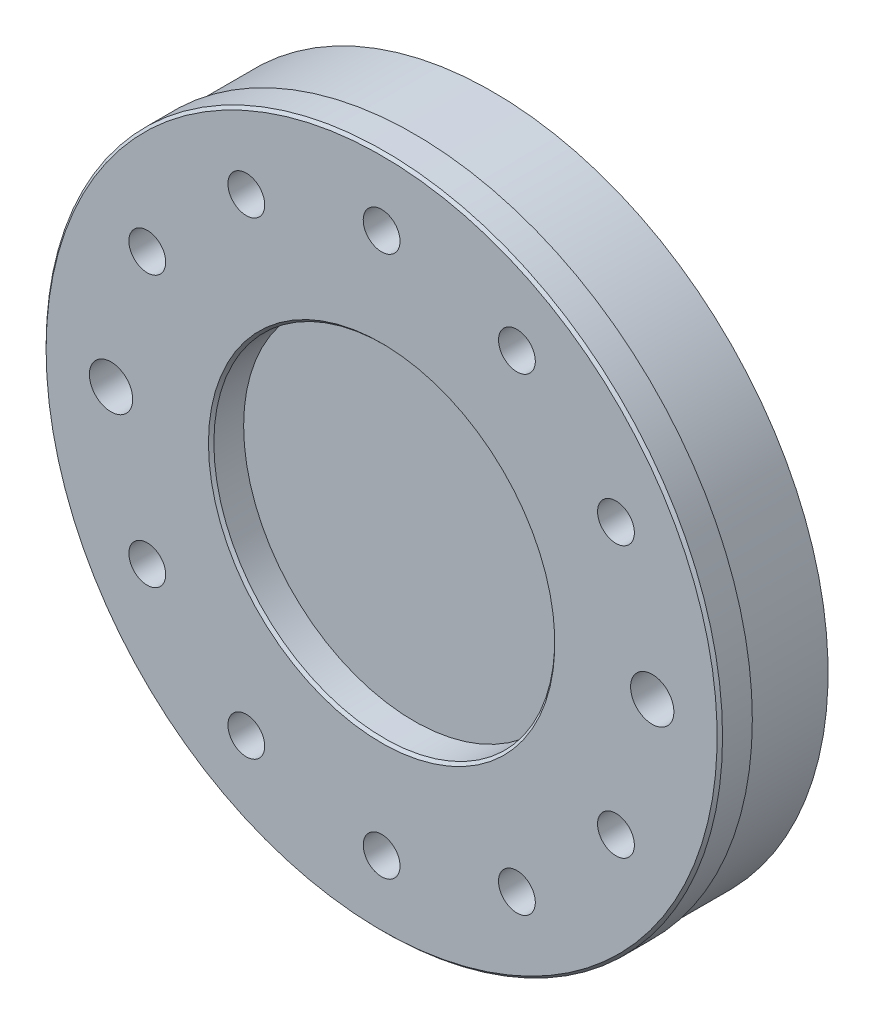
ISO-10303-21;
HEADER;
FILE_DESCRIPTION(('STEP AP214'),'2;1');
FILE_NAME('part.step','',(''),(''),'','','');
FILE_SCHEMA(('AUTOMOTIVE_DESIGN { 1 0 10303 214 1 1 1 1 }'));
ENDSEC;
DATA;
#1=APPLICATION_CONTEXT('core data for automotive mechanical design processes');
#2=APPLICATION_PROTOCOL_DEFINITION('international standard','automotive_design',2000,#1);
#3=PRODUCT_CONTEXT('',#1,'mechanical');
#4=PRODUCT('Part','Part','',(#3));
#5=PRODUCT_RELATED_PRODUCT_CATEGORY('part','',(#4));
#6=PRODUCT_DEFINITION_FORMATION('','',#4);
#7=PRODUCT_DEFINITION_CONTEXT('part definition',#1,'design');
#8=PRODUCT_DEFINITION('design','',#6,#7);
#9=PRODUCT_DEFINITION_SHAPE('','',#8);
#10=(LENGTH_UNIT() NAMED_UNIT(*) SI_UNIT(.MILLI.,.METRE.));
#11=(NAMED_UNIT(*) PLANE_ANGLE_UNIT() SI_UNIT($,.RADIAN.));
#12=(NAMED_UNIT(*) SI_UNIT($,.STERADIAN.) SOLID_ANGLE_UNIT());
#13=UNCERTAINTY_MEASURE_WITH_UNIT(LENGTH_MEASURE(1.E-05),#10,'distance_accuracy_value','');
#14=(GEOMETRIC_REPRESENTATION_CONTEXT(3) GLOBAL_UNCERTAINTY_ASSIGNED_CONTEXT((#13)) GLOBAL_UNIT_ASSIGNED_CONTEXT((#10,
#11,#12)) REPRESENTATION_CONTEXT('',''));
#15=CARTESIAN_POINT('',(0.,0.,0.));
#16=DIRECTION('',(0.,0.,1.));
#17=DIRECTION('',(1.,0.,0.));
#18=AXIS2_PLACEMENT_3D('',#15,#16,#17);
#19=CARTESIAN_POINT('',(0.,0.,0.));
#20=DIRECTION('',(0.,0.,-1.));
#21=DIRECTION('',(-1.,0.,0.));
#22=AXIS2_PLACEMENT_3D('',#19,#20,#21);
#23=PLANE('',#22);
#24=CARTESIAN_POINT('',(-24.9999999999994,-43.3012701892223,0.));
#25=DIRECTION('',(0.,0.,1.));
#26=DIRECTION('',(0.,-1.,0.));
#27=AXIS2_PLACEMENT_3D('',#24,#25,#26);
#28=CIRCLE('',#27,3.4);
#29=CARTESIAN_POINT('',(-24.9999999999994,-46.7012701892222,0.));
#30=VERTEX_POINT('',#29);
#31=EDGE_CURVE('E92',#30,#30,#28,.T.);
#32=ORIENTED_EDGE('',*,*,#31,.F.);
#33=EDGE_LOOP('',(#32));
#34=FACE_BOUND('',#33,.T.);
#35=CARTESIAN_POINT('',(-43.3012701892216,-25.0000000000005,0.));
#36=DIRECTION('',(0.,0.,1.));
#37=DIRECTION('',(0.,-1.,0.));
#38=AXIS2_PLACEMENT_3D('',#35,#36,#37);
#39=CIRCLE('',#38,3.4);
#40=CARTESIAN_POINT('',(-43.3012701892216,-28.4000000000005,0.));
#41=VERTEX_POINT('',#40);
#42=EDGE_CURVE('E100',#41,#41,#39,.T.);
#43=ORIENTED_EDGE('',*,*,#42,.F.);
#44=EDGE_LOOP('',(#43));
#45=FACE_BOUND('',#44,.T.);
#46=CARTESIAN_POINT('',(-43.3012701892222,24.9999999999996,0.));
#47=DIRECTION('',(0.,0.,1.));
#48=DIRECTION('',(0.,-1.,0.));
#49=AXIS2_PLACEMENT_3D('',#46,#47,#48);
#50=CIRCLE('',#49,3.4);
#51=CARTESIAN_POINT('',(-43.3012701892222,21.5999999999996,0.));
#52=VERTEX_POINT('',#51);
#53=EDGE_CURVE('E106',#52,#52,#50,.T.);
#54=ORIENTED_EDGE('',*,*,#53,.F.);
#55=EDGE_LOOP('',(#54));
#56=FACE_BOUND('',#55,.T.);
#57=CARTESIAN_POINT('',(-25.0000000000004,43.3012701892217,0.));
#58=DIRECTION('',(0.,0.,1.));
#59=DIRECTION('',(0.,-1.,0.));
#60=AXIS2_PLACEMENT_3D('',#57,#58,#59);
#61=CIRCLE('',#60,3.4);
#62=CARTESIAN_POINT('',(-25.0000000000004,39.9012701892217,0.));
#63=VERTEX_POINT('',#62);
#64=EDGE_CURVE('E112',#63,#63,#61,.T.);
#65=ORIENTED_EDGE('',*,*,#64,.F.);
#66=EDGE_LOOP('',(#65));
#67=FACE_BOUND('',#66,.T.);
#68=CARTESIAN_POINT('',(-3.49148336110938E-13,50.,0.));
#69=DIRECTION('',(0.,0.,1.));
#70=DIRECTION('',(0.,-1.,0.));
#71=AXIS2_PLACEMENT_3D('',#68,#69,#70);
#72=CIRCLE('',#71,3.4);
#73=CARTESIAN_POINT('',(-3.49148336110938E-13,46.6,0.));
#74=VERTEX_POINT('',#73);
#75=EDGE_CURVE('E118',#74,#74,#72,.T.);
#76=ORIENTED_EDGE('',*,*,#75,.F.);
#77=EDGE_LOOP('',(#76));
#78=FACE_BOUND('',#77,.T.);
#79=CARTESIAN_POINT('',(24.9999999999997,43.3012701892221,0.));
#80=DIRECTION('',(0.,0.,1.));
#81=DIRECTION('',(0.,-1.,0.));
#82=AXIS2_PLACEMENT_3D('',#79,#80,#81);
#83=CIRCLE('',#82,3.4);
#84=CARTESIAN_POINT('',(24.9999999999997,39.9012701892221,0.));
#85=VERTEX_POINT('',#84);
#86=EDGE_CURVE('E124',#85,#85,#83,.T.);
#87=ORIENTED_EDGE('',*,*,#86,.F.);
#88=EDGE_LOOP('',(#87));
#89=FACE_BOUND('',#88,.T.);
#90=CARTESIAN_POINT('',(43.3012701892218,25.0000000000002,0.));
#91=DIRECTION('',(0.,0.,1.));
#92=DIRECTION('',(0.,-1.,0.));
#93=AXIS2_PLACEMENT_3D('',#90,#91,#92);
#94=CIRCLE('',#93,3.39999999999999);
#95=CARTESIAN_POINT('',(43.3012701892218,21.6000000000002,0.));
#96=VERTEX_POINT('',#95);
#97=EDGE_CURVE('E130',#96,#96,#94,.T.);
#98=ORIENTED_EDGE('',*,*,#97,.F.);
#99=EDGE_LOOP('',(#98));
#100=FACE_BOUND('',#99,.T.);
#101=CARTESIAN_POINT('',(43.301270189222,-24.9999999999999,0.));
#102=DIRECTION('',(0.,0.,1.));
#103=DIRECTION('',(0.,-1.,0.));
#104=AXIS2_PLACEMENT_3D('',#101,#102,#103);
#105=CIRCLE('',#104,3.39999999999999);
#106=CARTESIAN_POINT('',(43.301270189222,-28.3999999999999,0.));
#107=VERTEX_POINT('',#106);
#108=EDGE_CURVE('E136',#107,#107,#105,.T.);
#109=ORIENTED_EDGE('',*,*,#108,.F.);
#110=EDGE_LOOP('',(#109));
#111=FACE_BOUND('',#110,.T.);
#112=CARTESIAN_POINT('',(25.,-43.3012701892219,0.));
#113=DIRECTION('',(0.,0.,1.));
#114=DIRECTION('',(0.,-1.,0.));
#115=AXIS2_PLACEMENT_3D('',#112,#113,#114);
#116=CIRCLE('',#115,3.4);
#117=CARTESIAN_POINT('',(25.,-46.7012701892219,0.));
#118=VERTEX_POINT('',#117);
#119=EDGE_CURVE('E142',#118,#118,#116,.T.);
#120=ORIENTED_EDGE('',*,*,#119,.F.);
#121=EDGE_LOOP('',(#120));
#122=FACE_BOUND('',#121,.T.);
#123=CARTESIAN_POINT('',(0.,-50.,0.));
#124=DIRECTION('',(0.,0.,1.));
#125=DIRECTION('',(1.,0.,0.));
#126=AXIS2_PLACEMENT_3D('',#123,#124,#125);
#127=CIRCLE('',#126,3.4);
#128=CARTESIAN_POINT('',(3.4,-50.,0.));
#129=VERTEX_POINT('',#128);
#130=EDGE_CURVE('E148',#129,#129,#127,.T.);
#131=ORIENTED_EDGE('',*,*,#130,.F.);
#132=EDGE_LOOP('',(#131));
#133=FACE_BOUND('',#132,.T.);
#134=CARTESIAN_POINT('',(50.,0.,0.));
#135=DIRECTION('',(0.,0.,1.));
#136=DIRECTION('',(1.,0.,0.));
#137=AXIS2_PLACEMENT_3D('',#134,#135,#136);
#138=CIRCLE('',#137,4.);
#139=CARTESIAN_POINT('',(54.,0.,0.));
#140=VERTEX_POINT('',#139);
#141=EDGE_CURVE('E154',#140,#140,#138,.T.);
#142=ORIENTED_EDGE('',*,*,#141,.F.);
#143=EDGE_LOOP('',(#142));
#144=FACE_BOUND('',#143,.T.);
#145=CARTESIAN_POINT('',(-50.,0.,0.));
#146=DIRECTION('',(0.,0.,1.));
#147=DIRECTION('',(1.,0.,0.));
#148=AXIS2_PLACEMENT_3D('',#145,#146,#147);
#149=CIRCLE('',#148,4.);
#150=CARTESIAN_POINT('',(-46.,0.,0.));
#151=VERTEX_POINT('',#150);
#152=EDGE_CURVE('E160',#151,#151,#149,.T.);
#153=ORIENTED_EDGE('',*,*,#152,.F.);
#154=EDGE_LOOP('',(#153));
#155=FACE_BOUND('',#154,.T.);
#156=CARTESIAN_POINT('',(0.,0.,0.));
#157=DIRECTION('',(0.,0.,-1.));
#158=DIRECTION('',(-1.,0.,0.));
#159=AXIS2_PLACEMENT_3D('',#156,#157,#158);
#160=CIRCLE('',#159,62.);
#161=CARTESIAN_POINT('',(-62.,0.,0.));
#162=VERTEX_POINT('',#161);
#163=EDGE_CURVE('E46',#162,#162,#160,.F.);
#164=ORIENTED_EDGE('',*,*,#163,.T.);
#165=EDGE_LOOP('',(#164));
#166=FACE_BOUND('',#165,.T.);
#167=CARTESIAN_POINT('',(0.,0.,0.));
#168=DIRECTION('',(0.,0.,-1.));
#169=DIRECTION('',(-1.,0.,0.));
#170=AXIS2_PLACEMENT_3D('',#167,#168,#169);
#171=CIRCLE('',#170,32.);
#172=CARTESIAN_POINT('',(-32.,0.,0.));
#173=VERTEX_POINT('',#172);
#174=EDGE_CURVE('E178',#173,#173,#171,.T.);
#175=ORIENTED_EDGE('',*,*,#174,.T.);
#176=EDGE_LOOP('',(#175));
#177=FACE_BOUND('',#176,.T.);
#178=ADVANCED_FACE('F38',(#34,#45,#56,#67,#78,#89,#100,#111,#122,#133,#144,#155,#166,#177),#23,.F.);
#179=CARTESIAN_POINT('',(0.,0.,-20.5));
#180=DIRECTION('',(0.,0.,1.));
#181=DIRECTION('',(1.,0.,0.));
#182=AXIS2_PLACEMENT_3D('',#179,#180,#181);
#183=PLANE('',#182);
#184=CARTESIAN_POINT('',(0.,0.,-20.5));
#185=DIRECTION('',(0.,0.,-1.));
#186=DIRECTION('',(-1.,0.,0.));
#187=AXIS2_PLACEMENT_3D('',#184,#185,#186);
#188=CIRCLE('',#187,62.);
#189=CARTESIAN_POINT('',(-62.,0.,-20.5));
#190=VERTEX_POINT('',#189);
#191=EDGE_CURVE('E172',#190,#190,#188,.T.);
#192=ORIENTED_EDGE('',*,*,#191,.T.);
#193=EDGE_LOOP('',(#192));
#194=FACE_BOUND('',#193,.T.);
#195=ADVANCED_FACE('F40',(#194),#183,.F.);
#196=CARTESIAN_POINT('',(0.,0.,-20.5));
#197=DIRECTION('',(0.,0.,-1.));
#198=DIRECTION('',(-1.,0.,0.));
#199=AXIS2_PLACEMENT_3D('',#196,#197,#198);
#200=CYLINDRICAL_SURFACE('',#199,62.);
#201=ORIENTED_EDGE('',*,*,#191,.F.);
#202=EDGE_LOOP('',(#201));
#203=FACE_BOUND('',#202,.T.);
#204=CARTESIAN_POINT('',(0.,0.,-6.));
#205=DIRECTION('',(0.,0.,-1.));
#206=DIRECTION('',(-1.,0.,0.));
#207=AXIS2_PLACEMENT_3D('',#204,#205,#206);
#208=CIRCLE('',#207,62.);
#209=CARTESIAN_POINT('',(-62.,0.,-6.));
#210=VERTEX_POINT('',#209);
#211=EDGE_CURVE('E169',#210,#210,#208,.T.);
#212=ORIENTED_EDGE('',*,*,#211,.T.);
#213=EDGE_LOOP('',(#212));
#214=FACE_BOUND('',#213,.T.);
#215=ADVANCED_FACE('F202',(#203,#214),#200,.T.);
#216=CARTESIAN_POINT('',(62.,0.,-6.));
#217=DIRECTION('',(0.,0.,1.));
#218=DIRECTION('',(1.,0.,0.));
#219=AXIS2_PLACEMENT_3D('',#216,#217,#218);
#220=PLANE('',#219);
#221=ORIENTED_EDGE('',*,*,#211,.F.);
#222=EDGE_LOOP('',(#221));
#223=FACE_BOUND('',#222,.T.);
#224=CARTESIAN_POINT('',(0.,0.,-6.));
#225=DIRECTION('',(0.,0.,-1.));
#226=DIRECTION('',(-1.,0.,0.));
#227=AXIS2_PLACEMENT_3D('',#224,#225,#226);
#228=CIRCLE('',#227,62.5);
#229=CARTESIAN_POINT('',(-62.5,0.,-6.));
#230=VERTEX_POINT('',#229);
#231=EDGE_CURVE('E166',#230,#230,#228,.T.);
#232=ORIENTED_EDGE('',*,*,#231,.T.);
#233=EDGE_LOOP('',(#232));
#234=FACE_BOUND('',#233,.T.);
#235=ADVANCED_FACE('F197',(#223,#234),#220,.F.);
#236=CARTESIAN_POINT('',(0.,0.,-20.5));
#237=DIRECTION('',(0.,0.,-1.));
#238=DIRECTION('',(-1.,0.,0.));
#239=AXIS2_PLACEMENT_3D('',#236,#237,#238);
#240=CYLINDRICAL_SURFACE('',#239,62.5);
#241=CARTESIAN_POINT('',(0.,0.,-0.499999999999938));
#242=DIRECTION('',(0.,0.,-1.));
#243=DIRECTION('',(-1.,0.,0.));
#244=AXIS2_PLACEMENT_3D('',#241,#242,#243);
#245=CIRCLE('',#244,62.5);
#246=CARTESIAN_POINT('',(-62.5,0.,-0.499999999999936));
#247=VERTEX_POINT('',#246);
#248=EDGE_CURVE('E175',#247,#247,#245,.T.);
#249=ORIENTED_EDGE('',*,*,#248,.T.);
#250=EDGE_LOOP('',(#249));
#251=FACE_BOUND('',#250,.T.);
#252=ORIENTED_EDGE('',*,*,#231,.F.);
#253=EDGE_LOOP('',(#252));
#254=FACE_BOUND('',#253,.T.);
#255=ADVANCED_FACE('F193',(#251,#254),#240,.T.);
#256=CARTESIAN_POINT('',(0.,0.,-6.));
#257=DIRECTION('',(0.,0.,1.));
#258=DIRECTION('',(1.,0.,0.));
#259=AXIS2_PLACEMENT_3D('',#256,#257,#258);
#260=CYLINDRICAL_SURFACE('',#259,31.5);
#261=CARTESIAN_POINT('',(0.,0.,-0.499999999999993));
#262=DIRECTION('',(0.,0.,-1.));
#263=DIRECTION('',(-1.,0.,0.));
#264=AXIS2_PLACEMENT_3D('',#261,#262,#263);
#265=CIRCLE('',#264,31.5);
#266=CARTESIAN_POINT('',(-31.5,0.,-0.499999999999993));
#267=VERTEX_POINT('',#266);
#268=EDGE_CURVE('E11',#267,#267,#265,.F.);
#269=ORIENTED_EDGE('',*,*,#268,.T.);
#270=EDGE_LOOP('',(#269));
#271=FACE_BOUND('',#270,.T.);
#272=CARTESIAN_POINT('',(0.,0.,-6.));
#273=DIRECTION('',(0.,0.,-1.));
#274=DIRECTION('',(-1.,0.,0.));
#275=AXIS2_PLACEMENT_3D('',#272,#273,#274);
#276=CIRCLE('',#275,31.5);
#277=CARTESIAN_POINT('',(-31.5,0.,-6.));
#278=VERTEX_POINT('',#277);
#279=EDGE_CURVE('E163',#278,#278,#276,.T.);
#280=ORIENTED_EDGE('',*,*,#279,.T.);
#281=EDGE_LOOP('',(#280));
#282=FACE_BOUND('',#281,.T.);
#283=ADVANCED_FACE('F196',(#271,#282),#260,.F.);
#284=CARTESIAN_POINT('',(0.,0.,-6.));
#285=DIRECTION('',(0.,0.,-1.));
#286=DIRECTION('',(-1.,0.,0.));
#287=AXIS2_PLACEMENT_3D('',#284,#285,#286);
#288=PLANE('',#287);
#289=ORIENTED_EDGE('',*,*,#279,.F.);
#290=EDGE_LOOP('',(#289));
#291=FACE_BOUND('',#290,.T.);
#292=ADVANCED_FACE('F189',(#291),#288,.F.);
#293=CARTESIAN_POINT('',(0.,0.,-0.499999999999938));
#294=DIRECTION('',(0.,0.,-1.));
#295=DIRECTION('',(-1.,0.,0.));
#296=AXIS2_PLACEMENT_3D('',#293,#294,#295);
#297=CONICAL_SURFACE('',#296,62.5,0.785398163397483);
#298=ORIENTED_EDGE('',*,*,#163,.F.);
#299=EDGE_LOOP('',(#298));
#300=FACE_BOUND('',#299,.T.);
#301=ORIENTED_EDGE('',*,*,#248,.F.);
#302=EDGE_LOOP('',(#301));
#303=FACE_BOUND('',#302,.T.);
#304=ADVANCED_FACE('F185',(#300,#303),#297,.T.);
#305=CARTESIAN_POINT('',(0.,0.,0.));
#306=DIRECTION('',(0.,0.,1.));
#307=DIRECTION('',(1.,0.,0.));
#308=AXIS2_PLACEMENT_3D('',#305,#306,#307);
#309=CONICAL_SURFACE('',#308,32.,0.785398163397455);
#310=ORIENTED_EDGE('',*,*,#268,.F.);
#311=EDGE_LOOP('',(#310));
#312=FACE_BOUND('',#311,.T.);
#313=ORIENTED_EDGE('',*,*,#174,.F.);
#314=EDGE_LOOP('',(#313));
#315=FACE_BOUND('',#314,.T.);
#316=ADVANCED_FACE('F188',(#312,#315),#309,.F.);
#317=CARTESIAN_POINT('',(-50.,0.,0.));
#318=DIRECTION('',(0.,0.,1.));
#319=DIRECTION('',(1.,0.,0.));
#320=AXIS2_PLACEMENT_3D('',#317,#318,#319);
#321=CYLINDRICAL_SURFACE('',#320,4.);
#322=CARTESIAN_POINT('',(-50.,0.,-15.));
#323=DIRECTION('',(0.,0.,1.));
#324=DIRECTION('',(1.,0.,0.));
#325=AXIS2_PLACEMENT_3D('',#322,#323,#324);
#326=CIRCLE('',#325,4.);
#327=CARTESIAN_POINT('',(-46.,0.,-15.));
#328=VERTEX_POINT('',#327);
#329=EDGE_CURVE('E157',#328,#328,#326,.T.);
#330=ORIENTED_EDGE('',*,*,#329,.F.);
#331=EDGE_LOOP('',(#330));
#332=FACE_BOUND('',#331,.T.);
#333=ORIENTED_EDGE('',*,*,#152,.T.);
#334=EDGE_LOOP('',(#333));
#335=FACE_BOUND('',#334,.T.);
#336=ADVANCED_FACE('F228',(#332,#335),#321,.F.);
#337=CARTESIAN_POINT('',(-50.,0.,-15.));
#338=DIRECTION('',(0.,0.,1.));
#339=DIRECTION('',(1.,0.,0.));
#340=AXIS2_PLACEMENT_3D('',#337,#338,#339);
#341=CONICAL_SURFACE('',#340,4.,1.02974425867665);
#342=CARTESIAN_POINT('',(-50.,0.,-17.4034424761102));
#343=VERTEX_POINT('',#342);
#344=VERTEX_LOOP('',#343);
#345=FACE_BOUND('',#344,.T.);
#346=ORIENTED_EDGE('',*,*,#329,.T.);
#347=EDGE_LOOP('',(#346));
#348=FACE_BOUND('',#347,.T.);
#349=ADVANCED_FACE('F232',(#345,#348),#341,.F.);
#350=CARTESIAN_POINT('',(50.,0.,0.));
#351=DIRECTION('',(0.,0.,1.));
#352=DIRECTION('',(1.,0.,0.));
#353=AXIS2_PLACEMENT_3D('',#350,#351,#352);
#354=CYLINDRICAL_SURFACE('',#353,4.);
#355=CARTESIAN_POINT('',(50.,0.,-15.));
#356=DIRECTION('',(0.,0.,1.));
#357=DIRECTION('',(1.,0.,0.));
#358=AXIS2_PLACEMENT_3D('',#355,#356,#357);
#359=CIRCLE('',#358,4.);
#360=CARTESIAN_POINT('',(54.,0.,-15.));
#361=VERTEX_POINT('',#360);
#362=EDGE_CURVE('E151',#361,#361,#359,.T.);
#363=ORIENTED_EDGE('',*,*,#362,.F.);
#364=EDGE_LOOP('',(#363));
#365=FACE_BOUND('',#364,.T.);
#366=ORIENTED_EDGE('',*,*,#141,.T.);
#367=EDGE_LOOP('',(#366));
#368=FACE_BOUND('',#367,.T.);
#369=ADVANCED_FACE('F236',(#365,#368),#354,.F.);
#370=CARTESIAN_POINT('',(50.,0.,-15.));
#371=DIRECTION('',(0.,0.,1.));
#372=DIRECTION('',(1.,0.,0.));
#373=AXIS2_PLACEMENT_3D('',#370,#371,#372);
#374=CONICAL_SURFACE('',#373,4.,1.02974425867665);
#375=CARTESIAN_POINT('',(50.,0.,-17.4034424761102));
#376=VERTEX_POINT('',#375);
#377=VERTEX_LOOP('',#376);
#378=FACE_BOUND('',#377,.T.);
#379=ORIENTED_EDGE('',*,*,#362,.T.);
#380=EDGE_LOOP('',(#379));
#381=FACE_BOUND('',#380,.T.);
#382=ADVANCED_FACE('F239',(#378,#381),#374,.F.);
#383=CARTESIAN_POINT('',(0.,-50.,0.));
#384=DIRECTION('',(0.,0.,1.));
#385=DIRECTION('',(1.,0.,0.));
#386=AXIS2_PLACEMENT_3D('',#383,#384,#385);
#387=CYLINDRICAL_SURFACE('',#386,3.4);
#388=CARTESIAN_POINT('',(0.,-50.,-18.));
#389=DIRECTION('',(0.,0.,1.));
#390=DIRECTION('',(1.,0.,0.));
#391=AXIS2_PLACEMENT_3D('',#388,#389,#390);
#392=CIRCLE('',#391,3.4);
#393=CARTESIAN_POINT('',(3.4,-50.,-18.));
#394=VERTEX_POINT('',#393);
#395=EDGE_CURVE('E145',#394,#394,#392,.T.);
#396=ORIENTED_EDGE('',*,*,#395,.F.);
#397=EDGE_LOOP('',(#396));
#398=FACE_BOUND('',#397,.T.);
#399=ORIENTED_EDGE('',*,*,#130,.T.);
#400=EDGE_LOOP('',(#399));
#401=FACE_BOUND('',#400,.T.);
#402=ADVANCED_FACE('F243',(#398,#401),#387,.F.);
#403=CARTESIAN_POINT('',(0.,-50.,-18.));
#404=DIRECTION('',(0.,0.,1.));
#405=DIRECTION('',(1.,0.,0.));
#406=AXIS2_PLACEMENT_3D('',#403,#404,#405);
#407=CONICAL_SURFACE('',#406,3.4,1.02974425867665);
#408=CARTESIAN_POINT('',(0.,-50.,-20.0429261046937));
#409=VERTEX_POINT('',#408);
#410=VERTEX_LOOP('',#409);
#411=FACE_BOUND('',#410,.T.);
#412=ORIENTED_EDGE('',*,*,#395,.T.);
#413=EDGE_LOOP('',(#412));
#414=FACE_BOUND('',#413,.T.);
#415=ADVANCED_FACE('F246',(#411,#414),#407,.F.);
#416=CARTESIAN_POINT('',(25.,-43.3012701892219,0.));
#417=DIRECTION('',(0.,0.,1.));
#418=DIRECTION('',(0.,-1.,0.));
#419=AXIS2_PLACEMENT_3D('',#416,#417,#418);
#420=CYLINDRICAL_SURFACE('',#419,3.4);
#421=CARTESIAN_POINT('',(25.,-43.3012701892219,-18.));
#422=DIRECTION('',(0.,0.,1.));
#423=DIRECTION('',(0.,-1.,0.));
#424=AXIS2_PLACEMENT_3D('',#421,#422,#423);
#425=CIRCLE('',#424,3.39999999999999);
#426=CARTESIAN_POINT('',(25.,-46.7012701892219,-18.));
#427=VERTEX_POINT('',#426);
#428=EDGE_CURVE('E139',#427,#427,#425,.T.);
#429=ORIENTED_EDGE('',*,*,#428,.F.);
#430=EDGE_LOOP('',(#429));
#431=FACE_BOUND('',#430,.T.);
#432=ORIENTED_EDGE('',*,*,#119,.T.);
#433=EDGE_LOOP('',(#432));
#434=FACE_BOUND('',#433,.T.);
#435=ADVANCED_FACE('F250',(#431,#434),#420,.F.);
#436=CARTESIAN_POINT('',(25.,-43.3012701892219,-18.));
#437=DIRECTION('',(0.,0.,1.));
#438=DIRECTION('',(0.,-1.,0.));
#439=AXIS2_PLACEMENT_3D('',#436,#437,#438);
#440=CONICAL_SURFACE('',#439,3.39999999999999,1.02974425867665);
#441=CARTESIAN_POINT('',(25.,-43.3012701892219,-20.0429261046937));
#442=VERTEX_POINT('',#441);
#443=VERTEX_LOOP('',#442);
#444=FACE_BOUND('',#443,.T.);
#445=ORIENTED_EDGE('',*,*,#428,.T.);
#446=EDGE_LOOP('',(#445));
#447=FACE_BOUND('',#446,.T.);
#448=ADVANCED_FACE('F254',(#444,#447),#440,.F.);
#449=CARTESIAN_POINT('',(43.301270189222,-24.9999999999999,0.));
#450=DIRECTION('',(0.,0.,1.));
#451=DIRECTION('',(0.,-1.,0.));
#452=AXIS2_PLACEMENT_3D('',#449,#450,#451);
#453=CYLINDRICAL_SURFACE('',#452,3.39999999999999);
#454=CARTESIAN_POINT('',(43.301270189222,-24.9999999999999,-18.));
#455=DIRECTION('',(0.,0.,1.));
#456=DIRECTION('',(0.,-1.,0.));
#457=AXIS2_PLACEMENT_3D('',#454,#455,#456);
#458=CIRCLE('',#457,3.39999999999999);
#459=CARTESIAN_POINT('',(43.301270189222,-28.3999999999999,-18.));
#460=VERTEX_POINT('',#459);
#461=EDGE_CURVE('E133',#460,#460,#458,.T.);
#462=ORIENTED_EDGE('',*,*,#461,.F.);
#463=EDGE_LOOP('',(#462));
#464=FACE_BOUND('',#463,.T.);
#465=ORIENTED_EDGE('',*,*,#108,.T.);
#466=EDGE_LOOP('',(#465));
#467=FACE_BOUND('',#466,.T.);
#468=ADVANCED_FACE('F258',(#464,#467),#453,.F.);
#469=CARTESIAN_POINT('',(43.301270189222,-24.9999999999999,-18.));
#470=DIRECTION('',(0.,0.,1.));
#471=DIRECTION('',(0.,-1.,0.));
#472=AXIS2_PLACEMENT_3D('',#469,#470,#471);
#473=CONICAL_SURFACE('',#472,3.39999999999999,1.02974425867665);
#474=CARTESIAN_POINT('',(43.301270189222,-24.9999999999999,-20.0429261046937));
#475=VERTEX_POINT('',#474);
#476=VERTEX_LOOP('',#475);
#477=FACE_BOUND('',#476,.T.);
#478=ORIENTED_EDGE('',*,*,#461,.T.);
#479=EDGE_LOOP('',(#478));
#480=FACE_BOUND('',#479,.T.);
#481=ADVANCED_FACE('F262',(#477,#480),#473,.F.);
#482=CARTESIAN_POINT('',(43.3012701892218,25.0000000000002,0.));
#483=DIRECTION('',(0.,0.,1.));
#484=DIRECTION('',(0.,-1.,0.));
#485=AXIS2_PLACEMENT_3D('',#482,#483,#484);
#486=CYLINDRICAL_SURFACE('',#485,3.39999999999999);
#487=CARTESIAN_POINT('',(43.3012701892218,25.0000000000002,-18.));
#488=DIRECTION('',(0.,0.,1.));
#489=DIRECTION('',(0.,-1.,0.));
#490=AXIS2_PLACEMENT_3D('',#487,#488,#489);
#491=CIRCLE('',#490,3.39999999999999);
#492=CARTESIAN_POINT('',(43.3012701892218,21.6000000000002,-18.));
#493=VERTEX_POINT('',#492);
#494=EDGE_CURVE('E127',#493,#493,#491,.T.);
#495=ORIENTED_EDGE('',*,*,#494,.F.);
#496=EDGE_LOOP('',(#495));
#497=FACE_BOUND('',#496,.T.);
#498=ORIENTED_EDGE('',*,*,#97,.T.);
#499=EDGE_LOOP('',(#498));
#500=FACE_BOUND('',#499,.T.);
#501=ADVANCED_FACE('F266',(#497,#500),#486,.F.);
#502=CARTESIAN_POINT('',(43.3012701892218,25.0000000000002,-18.));
#503=DIRECTION('',(0.,0.,1.));
#504=DIRECTION('',(0.,-1.,0.));
#505=AXIS2_PLACEMENT_3D('',#502,#503,#504);
#506=CONICAL_SURFACE('',#505,3.39999999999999,1.02974425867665);
#507=CARTESIAN_POINT('',(43.3012701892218,25.0000000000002,-20.0429261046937));
#508=VERTEX_POINT('',#507);
#509=VERTEX_LOOP('',#508);
#510=FACE_BOUND('',#509,.T.);
#511=ORIENTED_EDGE('',*,*,#494,.T.);
#512=EDGE_LOOP('',(#511));
#513=FACE_BOUND('',#512,.T.);
#514=ADVANCED_FACE('F270',(#510,#513),#506,.F.);
#515=CARTESIAN_POINT('',(24.9999999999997,43.3012701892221,0.));
#516=DIRECTION('',(0.,0.,1.));
#517=DIRECTION('',(0.,-1.,0.));
#518=AXIS2_PLACEMENT_3D('',#515,#516,#517);
#519=CYLINDRICAL_SURFACE('',#518,3.4);
#520=CARTESIAN_POINT('',(24.9999999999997,43.3012701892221,-18.));
#521=DIRECTION('',(0.,0.,1.));
#522=DIRECTION('',(0.,-1.,0.));
#523=AXIS2_PLACEMENT_3D('',#520,#521,#522);
#524=CIRCLE('',#523,3.4);
#525=CARTESIAN_POINT('',(24.9999999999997,39.9012701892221,-18.));
#526=VERTEX_POINT('',#525);
#527=EDGE_CURVE('E121',#526,#526,#524,.T.);
#528=ORIENTED_EDGE('',*,*,#527,.F.);
#529=EDGE_LOOP('',(#528));
#530=FACE_BOUND('',#529,.T.);
#531=ORIENTED_EDGE('',*,*,#86,.T.);
#532=EDGE_LOOP('',(#531));
#533=FACE_BOUND('',#532,.T.);
#534=ADVANCED_FACE('F274',(#530,#533),#519,.F.);
#535=CARTESIAN_POINT('',(24.9999999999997,43.3012701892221,-18.));
#536=DIRECTION('',(0.,0.,1.));
#537=DIRECTION('',(0.,-1.,0.));
#538=AXIS2_PLACEMENT_3D('',#535,#536,#537);
#539=CONICAL_SURFACE('',#538,3.4,1.02974425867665);
#540=CARTESIAN_POINT('',(24.9999999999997,43.3012701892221,-20.0429261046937));
#541=VERTEX_POINT('',#540);
#542=VERTEX_LOOP('',#541);
#543=FACE_BOUND('',#542,.T.);
#544=ORIENTED_EDGE('',*,*,#527,.T.);
#545=EDGE_LOOP('',(#544));
#546=FACE_BOUND('',#545,.T.);
#547=ADVANCED_FACE('F278',(#543,#546),#539,.F.);
#548=CARTESIAN_POINT('',(-3.49148336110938E-13,50.,0.));
#549=DIRECTION('',(0.,0.,1.));
#550=DIRECTION('',(0.,-1.,0.));
#551=AXIS2_PLACEMENT_3D('',#548,#549,#550);
#552=CYLINDRICAL_SURFACE('',#551,3.4);
#553=CARTESIAN_POINT('',(-3.49148336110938E-13,50.,-18.));
#554=DIRECTION('',(0.,0.,1.));
#555=DIRECTION('',(0.,-1.,0.));
#556=AXIS2_PLACEMENT_3D('',#553,#554,#555);
#557=CIRCLE('',#556,3.4);
#558=CARTESIAN_POINT('',(-3.49148336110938E-13,46.6,-18.));
#559=VERTEX_POINT('',#558);
#560=EDGE_CURVE('E115',#559,#559,#557,.T.);
#561=ORIENTED_EDGE('',*,*,#560,.F.);
#562=EDGE_LOOP('',(#561));
#563=FACE_BOUND('',#562,.T.);
#564=ORIENTED_EDGE('',*,*,#75,.T.);
#565=EDGE_LOOP('',(#564));
#566=FACE_BOUND('',#565,.T.);
#567=ADVANCED_FACE('F282',(#563,#566),#552,.F.);
#568=CARTESIAN_POINT('',(-3.49148336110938E-13,50.,-18.));
#569=DIRECTION('',(0.,0.,1.));
#570=DIRECTION('',(0.,-1.,0.));
#571=AXIS2_PLACEMENT_3D('',#568,#569,#570);
#572=CONICAL_SURFACE('',#571,3.4,1.02974425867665);
#573=CARTESIAN_POINT('',(-3.54057275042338E-13,50.,-20.0429261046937));
#574=VERTEX_POINT('',#573);
#575=VERTEX_LOOP('',#574);
#576=FACE_BOUND('',#575,.T.);
#577=ORIENTED_EDGE('',*,*,#560,.T.);
#578=EDGE_LOOP('',(#577));
#579=FACE_BOUND('',#578,.T.);
#580=ADVANCED_FACE('F286',(#576,#579),#572,.F.);
#581=CARTESIAN_POINT('',(-25.0000000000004,43.3012701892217,0.));
#582=DIRECTION('',(0.,0.,1.));
#583=DIRECTION('',(0.,-1.,0.));
#584=AXIS2_PLACEMENT_3D('',#581,#582,#583);
#585=CYLINDRICAL_SURFACE('',#584,3.4);
#586=CARTESIAN_POINT('',(-25.0000000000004,43.3012701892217,-18.));
#587=DIRECTION('',(0.,0.,1.));
#588=DIRECTION('',(0.,-1.,0.));
#589=AXIS2_PLACEMENT_3D('',#586,#587,#588);
#590=CIRCLE('',#589,3.39999999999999);
#591=CARTESIAN_POINT('',(-25.0000000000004,39.9012701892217,-18.));
#592=VERTEX_POINT('',#591);
#593=EDGE_CURVE('E109',#592,#592,#590,.T.);
#594=ORIENTED_EDGE('',*,*,#593,.F.);
#595=EDGE_LOOP('',(#594));
#596=FACE_BOUND('',#595,.T.);
#597=ORIENTED_EDGE('',*,*,#64,.T.);
#598=EDGE_LOOP('',(#597));
#599=FACE_BOUND('',#598,.T.);
#600=ADVANCED_FACE('F290',(#596,#599),#585,.F.);
#601=CARTESIAN_POINT('',(-25.0000000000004,43.3012701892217,-18.));
#602=DIRECTION('',(0.,0.,1.));
#603=DIRECTION('',(0.,-1.,0.));
#604=AXIS2_PLACEMENT_3D('',#601,#602,#603);
#605=CONICAL_SURFACE('',#604,3.39999999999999,1.02974425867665);
#606=CARTESIAN_POINT('',(-25.0000000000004,43.3012701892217,-20.0429261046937));
#607=VERTEX_POINT('',#606);
#608=VERTEX_LOOP('',#607);
#609=FACE_BOUND('',#608,.T.);
#610=ORIENTED_EDGE('',*,*,#593,.T.);
#611=EDGE_LOOP('',(#610));
#612=FACE_BOUND('',#611,.T.);
#613=ADVANCED_FACE('F294',(#609,#612),#605,.F.);
#614=CARTESIAN_POINT('',(-43.3012701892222,24.9999999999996,0.));
#615=DIRECTION('',(0.,0.,1.));
#616=DIRECTION('',(0.,-1.,0.));
#617=AXIS2_PLACEMENT_3D('',#614,#615,#616);
#618=CYLINDRICAL_SURFACE('',#617,3.4);
#619=CARTESIAN_POINT('',(-43.3012701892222,24.9999999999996,-18.));
#620=DIRECTION('',(0.,0.,1.));
#621=DIRECTION('',(0.,-1.,0.));
#622=AXIS2_PLACEMENT_3D('',#619,#620,#621);
#623=CIRCLE('',#622,3.39999999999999);
#624=CARTESIAN_POINT('',(-43.3012701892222,21.5999999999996,-18.));
#625=VERTEX_POINT('',#624);
#626=EDGE_CURVE('E103',#625,#625,#623,.T.);
#627=ORIENTED_EDGE('',*,*,#626,.F.);
#628=EDGE_LOOP('',(#627));
#629=FACE_BOUND('',#628,.T.);
#630=ORIENTED_EDGE('',*,*,#53,.T.);
#631=EDGE_LOOP('',(#630));
#632=FACE_BOUND('',#631,.T.);
#633=ADVANCED_FACE('F298',(#629,#632),#618,.F.);
#634=CARTESIAN_POINT('',(-43.3012701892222,24.9999999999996,-18.));
#635=DIRECTION('',(0.,0.,1.));
#636=DIRECTION('',(0.,-1.,0.));
#637=AXIS2_PLACEMENT_3D('',#634,#635,#636);
#638=CONICAL_SURFACE('',#637,3.39999999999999,1.02974425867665);
#639=CARTESIAN_POINT('',(-43.3012701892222,24.9999999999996,-20.0429261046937));
#640=VERTEX_POINT('',#639);
#641=VERTEX_LOOP('',#640);
#642=FACE_BOUND('',#641,.T.);
#643=ORIENTED_EDGE('',*,*,#626,.T.);
#644=EDGE_LOOP('',(#643));
#645=FACE_BOUND('',#644,.T.);
#646=ADVANCED_FACE('F302',(#642,#645),#638,.F.);
#647=CARTESIAN_POINT('',(-43.3012701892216,-25.0000000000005,0.));
#648=DIRECTION('',(0.,0.,1.));
#649=DIRECTION('',(0.,-1.,0.));
#650=AXIS2_PLACEMENT_3D('',#647,#648,#649);
#651=CYLINDRICAL_SURFACE('',#650,3.4);
#652=CARTESIAN_POINT('',(-43.3012701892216,-25.0000000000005,-18.));
#653=DIRECTION('',(0.,0.,1.));
#654=DIRECTION('',(0.,-1.,0.));
#655=AXIS2_PLACEMENT_3D('',#652,#653,#654);
#656=CIRCLE('',#655,3.39999999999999);
#657=CARTESIAN_POINT('',(-43.3012701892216,-28.4000000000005,-18.));
#658=VERTEX_POINT('',#657);
#659=EDGE_CURVE('E95',#658,#658,#656,.T.);
#660=ORIENTED_EDGE('',*,*,#659,.F.);
#661=EDGE_LOOP('',(#660));
#662=FACE_BOUND('',#661,.T.);
#663=ORIENTED_EDGE('',*,*,#42,.T.);
#664=EDGE_LOOP('',(#663));
#665=FACE_BOUND('',#664,.T.);
#666=ADVANCED_FACE('F306',(#662,#665),#651,.F.);
#667=CARTESIAN_POINT('',(-43.3012701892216,-25.0000000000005,-18.));
#668=DIRECTION('',(0.,0.,1.));
#669=DIRECTION('',(0.,-1.,0.));
#670=AXIS2_PLACEMENT_3D('',#667,#668,#669);
#671=CONICAL_SURFACE('',#670,3.39999999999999,1.02974425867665);
#672=CARTESIAN_POINT('',(-43.3012701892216,-25.0000000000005,-20.0429261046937));
#673=VERTEX_POINT('',#672);
#674=VERTEX_LOOP('',#673);
#675=FACE_BOUND('',#674,.T.);
#676=ORIENTED_EDGE('',*,*,#659,.T.);
#677=EDGE_LOOP('',(#676));
#678=FACE_BOUND('',#677,.T.);
#679=ADVANCED_FACE('F310',(#675,#678),#671,.F.);
#680=CARTESIAN_POINT('',(-24.9999999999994,-43.3012701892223,0.));
#681=DIRECTION('',(0.,0.,1.));
#682=DIRECTION('',(0.,-1.,0.));
#683=AXIS2_PLACEMENT_3D('',#680,#681,#682);
#684=CYLINDRICAL_SURFACE('',#683,3.4);
#685=CARTESIAN_POINT('',(-24.9999999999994,-43.3012701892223,-18.));
#686=DIRECTION('',(0.,0.,1.));
#687=DIRECTION('',(0.,-1.,0.));
#688=AXIS2_PLACEMENT_3D('',#685,#686,#687);
#689=CIRCLE('',#688,3.39999999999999);
#690=CARTESIAN_POINT('',(-24.9999999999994,-46.7012701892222,-18.));
#691=VERTEX_POINT('',#690);
#692=EDGE_CURVE('E90',#691,#691,#689,.T.);
#693=ORIENTED_EDGE('',*,*,#692,.F.);
#694=EDGE_LOOP('',(#693));
#695=FACE_BOUND('',#694,.T.);
#696=ORIENTED_EDGE('',*,*,#31,.T.);
#697=EDGE_LOOP('',(#696));
#698=FACE_BOUND('',#697,.T.);
#699=ADVANCED_FACE('F86',(#695,#698),#684,.F.);
#700=CARTESIAN_POINT('',(-24.9999999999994,-43.3012701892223,-18.));
#701=DIRECTION('',(0.,0.,1.));
#702=DIRECTION('',(0.,-1.,0.));
#703=AXIS2_PLACEMENT_3D('',#700,#701,#702);
#704=CONICAL_SURFACE('',#703,3.39999999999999,1.02974425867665);
#705=CARTESIAN_POINT('',(-24.9999999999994,-43.3012701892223,-20.0429261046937));
#706=VERTEX_POINT('',#705);
#707=VERTEX_LOOP('',#706);
#708=FACE_BOUND('',#707,.T.);
#709=ORIENTED_EDGE('',*,*,#692,.T.);
#710=EDGE_LOOP('',(#709));
#711=FACE_BOUND('',#710,.T.);
#712=ADVANCED_FACE('F83',(#708,#711),#704,.F.);
#713=CLOSED_SHELL('',(#178,#195,#215,#235,#255,#283,#292,#304,#316,#336,#349,#369,#382,#402,
#415,#435,#448,#468,#481,#501,#514,#534,#547,#567,#580,#600,#613,#633,#646,#666,#679,#699,#712));
#714=MANIFOLD_SOLID_BREP('B2',#713);
#715=ADVANCED_BREP_SHAPE_REPRESENTATION('',(#18,#714),#14);
#716=SHAPE_DEFINITION_REPRESENTATION(#9,#715);
ENDSEC;
END-ISO-10303-21;
